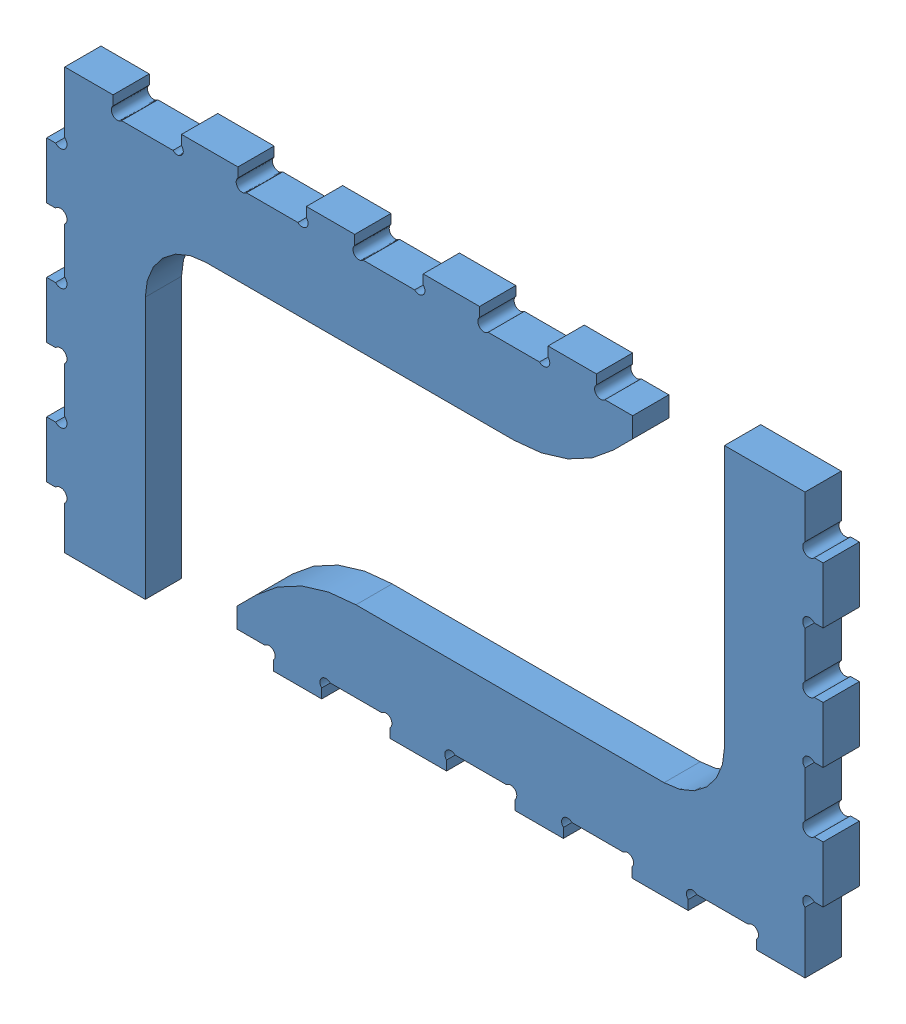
SolidWorks assembly Assemblagesupport.SLDASM, configuration Défaut (file format 10000). Lengths in mm.
Overall size (385.61 210 18).
2 component instances, 1 part files, 2 mates.
Components (placement in the parent):
- support -1: support .SLDPRT [Défaut] at origin size (291 209 18)
- support -2: support .SLDPRT [Défaut] at (367.6149 210 0) x (-1 0 0) z (0 0 1) size (291 209 18)
Mates (geometry in assembly coordinates):
- Coïncidente1: coincident aligned: plane of support -1 through (-2.11 23.89 0) normal (0 0 -1); plane of support -2 through (369.7249 186.11 0) normal (0 0 -1)
- Distance1: distance = 110 mm anti-aligned: plane of support -1 through (282 160 18) normal (0 -1 0); plane of support -2 through (85.6149 50 18) normal (0 1 0)
